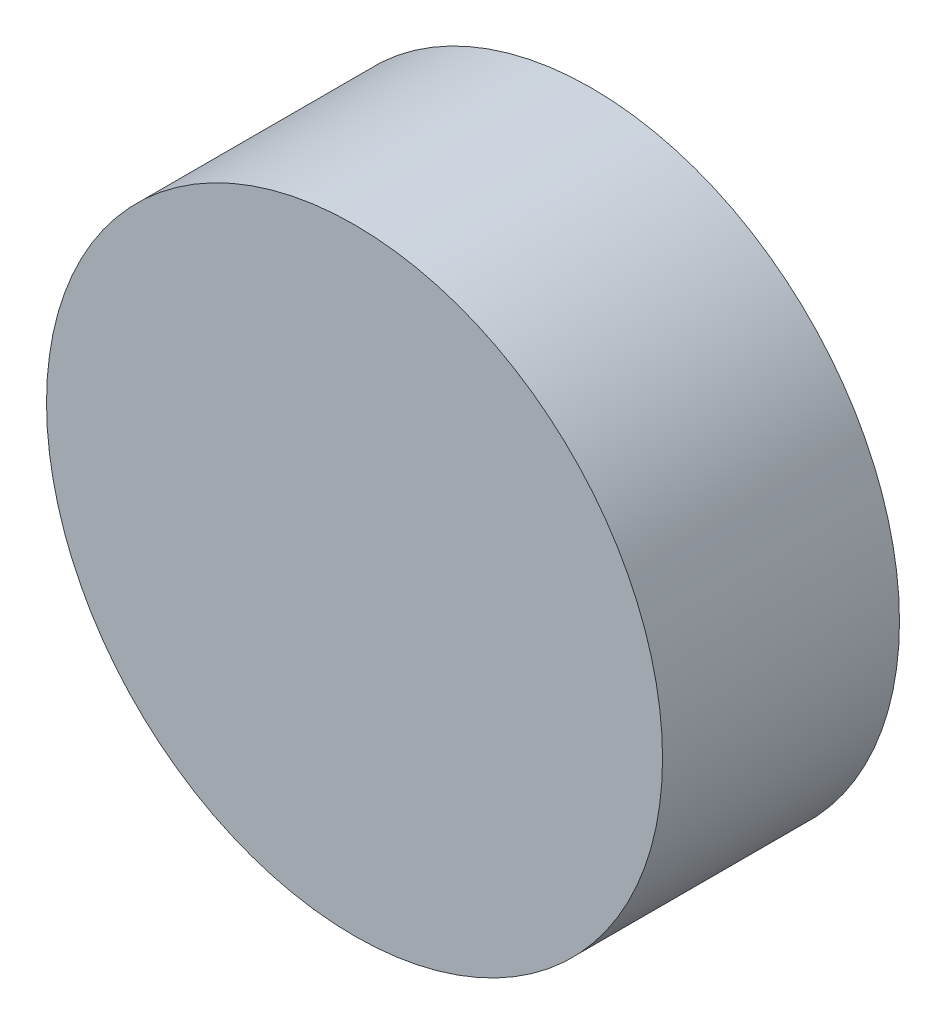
ISO-10303-21;
HEADER;
FILE_DESCRIPTION(('STEP AP214'),'2;1');
FILE_NAME('part.step','',(''),(''),'','','');
FILE_SCHEMA(('AUTOMOTIVE_DESIGN { 1 0 10303 214 1 1 1 1 }'));
ENDSEC;
DATA;
#1=APPLICATION_CONTEXT('core data for automotive mechanical design processes');
#2=APPLICATION_PROTOCOL_DEFINITION('international standard','automotive_design',2000,#1);
#3=PRODUCT_CONTEXT('',#1,'mechanical');
#4=PRODUCT('Part','Part','',(#3));
#5=PRODUCT_RELATED_PRODUCT_CATEGORY('part','',(#4));
#6=PRODUCT_DEFINITION_FORMATION('','',#4);
#7=PRODUCT_DEFINITION_CONTEXT('part definition',#1,'design');
#8=PRODUCT_DEFINITION('design','',#6,#7);
#9=PRODUCT_DEFINITION_SHAPE('','',#8);
#10=(LENGTH_UNIT() NAMED_UNIT(*) SI_UNIT(.MILLI.,.METRE.));
#11=(NAMED_UNIT(*) PLANE_ANGLE_UNIT() SI_UNIT($,.RADIAN.));
#12=(NAMED_UNIT(*) SI_UNIT($,.STERADIAN.) SOLID_ANGLE_UNIT());
#13=UNCERTAINTY_MEASURE_WITH_UNIT(LENGTH_MEASURE(1.E-05),#10,'distance_accuracy_value','');
#14=(GEOMETRIC_REPRESENTATION_CONTEXT(3) GLOBAL_UNCERTAINTY_ASSIGNED_CONTEXT((#13)) GLOBAL_UNIT_ASSIGNED_CONTEXT((#10,
#11,#12)) REPRESENTATION_CONTEXT('',''));
#15=CARTESIAN_POINT('',(0.,0.,0.));
#16=DIRECTION('',(0.,0.,1.));
#17=DIRECTION('',(1.,0.,0.));
#18=AXIS2_PLACEMENT_3D('',#15,#16,#17);
#19=CARTESIAN_POINT('',(0.,0.,5.));
#20=DIRECTION('',(0.,0.,-1.));
#21=DIRECTION('',(-0.999999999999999,0.,0.));
#22=AXIS2_PLACEMENT_3D('',#19,#20,#21);
#23=CYLINDRICAL_SURFACE('',#22,6.5);
#24=CARTESIAN_POINT('',(0.,0.,5.));
#25=DIRECTION('',(0.,0.,1.));
#26=DIRECTION('',(0.999999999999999,0.,0.));
#27=AXIS2_PLACEMENT_3D('',#24,#25,#26);
#28=CIRCLE('',#27,6.5);
#29=CARTESIAN_POINT('',(-6.49999999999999,0.,5.));
#30=VERTEX_POINT('',#29);
#31=EDGE_CURVE('E88',#30,#30,#28,.T.);
#32=CARTESIAN_POINT('',(0.,0.,0.));
#33=DIRECTION('',(0.,0.,1.));
#34=DIRECTION('',(0.999999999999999,0.,0.));
#35=AXIS2_PLACEMENT_3D('',#32,#33,#34);
#36=CIRCLE('',#35,6.5);
#37=CARTESIAN_POINT('',(-6.49999999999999,0.,0.));
#38=VERTEX_POINT('',#37);
#39=EDGE_CURVE('E85',#38,#38,#36,.T.);
#40=CARTESIAN_POINT('',(-6.49999999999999,0.,5.));
#41=CARTESIAN_POINT('',(-6.49999999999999,0.,4.94791666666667));
#42=CARTESIAN_POINT('',(-6.49999999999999,0.,4.89583333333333));
#43=CARTESIAN_POINT('',(-6.49999999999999,0.,4.79166666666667));
#44=CARTESIAN_POINT('',(-6.49999999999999,0.,4.73958333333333));
#45=CARTESIAN_POINT('',(-6.49999999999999,0.,4.63541666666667));
#46=CARTESIAN_POINT('',(-6.49999999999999,0.,4.58333333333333));
#47=CARTESIAN_POINT('',(-6.49999999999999,0.,4.47916666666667));
#48=CARTESIAN_POINT('',(-6.49999999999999,0.,4.42708333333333));
#49=CARTESIAN_POINT('',(-6.49999999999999,0.,4.32291666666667));
#50=CARTESIAN_POINT('',(-6.49999999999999,0.,4.27083333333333));
#51=CARTESIAN_POINT('',(-6.49999999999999,0.,4.16666666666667));
#52=CARTESIAN_POINT('',(-6.49999999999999,0.,4.11458333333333));
#53=CARTESIAN_POINT('',(-6.49999999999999,0.,4.01041666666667));
#54=CARTESIAN_POINT('',(-6.49999999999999,0.,3.95833333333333));
#55=CARTESIAN_POINT('',(-6.49999999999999,0.,3.85416666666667));
#56=CARTESIAN_POINT('',(-6.49999999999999,0.,3.80208333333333));
#57=CARTESIAN_POINT('',(-6.49999999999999,0.,3.69791666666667));
#58=CARTESIAN_POINT('',(-6.49999999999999,0.,3.64583333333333));
#59=CARTESIAN_POINT('',(-6.49999999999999,0.,3.54166666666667));
#60=CARTESIAN_POINT('',(-6.49999999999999,0.,3.48958333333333));
#61=CARTESIAN_POINT('',(-6.49999999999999,0.,3.38541666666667));
#62=CARTESIAN_POINT('',(-6.49999999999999,0.,3.33333333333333));
#63=CARTESIAN_POINT('',(-6.49999999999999,0.,3.22916666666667));
#64=CARTESIAN_POINT('',(-6.49999999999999,0.,3.17708333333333));
#65=CARTESIAN_POINT('',(-6.49999999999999,0.,3.07291666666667));
#66=CARTESIAN_POINT('',(-6.49999999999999,0.,3.02083333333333));
#67=CARTESIAN_POINT('',(-6.49999999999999,0.,2.91666666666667));
#68=CARTESIAN_POINT('',(-6.49999999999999,0.,2.86458333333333));
#69=CARTESIAN_POINT('',(-6.49999999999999,0.,2.76041666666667));
#70=CARTESIAN_POINT('',(-6.49999999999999,0.,2.70833333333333));
#71=CARTESIAN_POINT('',(-6.49999999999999,0.,2.60416666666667));
#72=CARTESIAN_POINT('',(-6.49999999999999,0.,2.55208333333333));
#73=CARTESIAN_POINT('',(-6.49999999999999,0.,2.44791666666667));
#74=CARTESIAN_POINT('',(-6.49999999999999,0.,2.39583333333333));
#75=CARTESIAN_POINT('',(-6.49999999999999,0.,2.29166666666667));
#76=CARTESIAN_POINT('',(-6.49999999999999,0.,2.23958333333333));
#77=CARTESIAN_POINT('',(-6.49999999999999,0.,2.13541666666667));
#78=CARTESIAN_POINT('',(-6.49999999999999,0.,2.08333333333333));
#79=CARTESIAN_POINT('',(-6.49999999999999,0.,1.97916666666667));
#80=CARTESIAN_POINT('',(-6.49999999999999,0.,1.92708333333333));
#81=CARTESIAN_POINT('',(-6.49999999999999,0.,1.82291666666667));
#82=CARTESIAN_POINT('',(-6.49999999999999,0.,1.77083333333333));
#83=CARTESIAN_POINT('',(-6.49999999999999,0.,1.66666666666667));
#84=CARTESIAN_POINT('',(-6.49999999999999,0.,1.61458333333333));
#85=CARTESIAN_POINT('',(-6.49999999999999,0.,1.51041666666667));
#86=CARTESIAN_POINT('',(-6.49999999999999,0.,1.45833333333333));
#87=CARTESIAN_POINT('',(-6.49999999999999,0.,1.35416666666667));
#88=CARTESIAN_POINT('',(-6.49999999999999,0.,1.30208333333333));
#89=CARTESIAN_POINT('',(-6.49999999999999,0.,1.19791666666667));
#90=CARTESIAN_POINT('',(-6.49999999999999,0.,1.14583333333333));
#91=CARTESIAN_POINT('',(-6.49999999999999,0.,1.04166666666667));
#92=CARTESIAN_POINT('',(-6.49999999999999,0.,0.989583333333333));
#93=CARTESIAN_POINT('',(-6.49999999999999,0.,0.885416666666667));
#94=CARTESIAN_POINT('',(-6.49999999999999,0.,0.833333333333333));
#95=CARTESIAN_POINT('',(-6.49999999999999,0.,0.729166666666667));
#96=CARTESIAN_POINT('',(-6.49999999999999,0.,0.677083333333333));
#97=CARTESIAN_POINT('',(-6.49999999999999,0.,0.572916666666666));
#98=CARTESIAN_POINT('',(-6.49999999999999,0.,0.520833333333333));
#99=CARTESIAN_POINT('',(-6.49999999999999,0.,0.416666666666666));
#100=CARTESIAN_POINT('',(-6.49999999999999,0.,0.364583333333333));
#101=CARTESIAN_POINT('',(-6.49999999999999,0.,0.260416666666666));
#102=CARTESIAN_POINT('',(-6.49999999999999,0.,0.208333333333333));
#103=CARTESIAN_POINT('',(-6.49999999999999,0.,0.104166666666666));
#104=CARTESIAN_POINT('',(-6.49999999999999,0.,0.0520833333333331));
#105=CARTESIAN_POINT('',(-6.49999999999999,0.,0.));
#106=B_SPLINE_CURVE_WITH_KNOTS('',3,(#40,#41,#42,#43,#44,#45,#46,#47,#48,#49,#50,#51,#52,#53,
#54,#55,#56,#57,#58,#59,#60,#61,#62,#63,#64,#65,#66,#67,#68,#69,#70,#71,#72,#73,#74,#75,#76,#77,
#78,#79,#80,#81,#82,#83,#84,#85,#86,#87,#88,#89,#90,#91,#92,#93,#94,#95,#96,#97,#98,#99,#100,
#101,#102,#103,#104,#105),.UNSPECIFIED.,.F.,.F.,(4,2,2,2,2,2,2,2,2,2,2,2,2,2,2,2,2,2,2,2,2,2,2,
2,2,2,2,2,2,2,2,2,4),(0.,0.15625,0.3125,0.46875,0.625000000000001,0.781250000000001,
0.937500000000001,1.09375,1.25,1.40625,1.5625,1.71875,1.875,2.03125,2.1875,2.34375,2.5,2.65625,
2.8125,2.96875,3.125,3.28125,3.4375,3.59375,3.75,3.90625,4.0625,4.21875,4.375,4.53125,4.6875,
4.84375,5.),.UNSPECIFIED.);
#107=EDGE_CURVE('BSEAM36',#30,#38,#106,.T.);
#108=ORIENTED_EDGE('',*,*,#31,.F.);
#109=ORIENTED_EDGE('',*,*,#39,.T.);
#110=ORIENTED_EDGE('',*,*,#107,.T.);
#111=ORIENTED_EDGE('',*,*,#107,.F.);
#112=EDGE_LOOP('',(#108,#110,#109,#111));
#113=FACE_BOUND('',#112,.T.);
#114=ADVANCED_FACE('F36',(#113),#23,.T.);
#115=CARTESIAN_POINT('',(0.,0.,5.));
#116=DIRECTION('',(0.,0.,1.));
#117=DIRECTION('',(0.999999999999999,0.,0.));
#118=AXIS2_PLACEMENT_3D('',#115,#116,#117);
#119=PLANE('',#118);
#120=ORIENTED_EDGE('',*,*,#31,.T.);
#121=EDGE_LOOP('',(#120));
#122=FACE_BOUND('',#121,.T.);
#123=ADVANCED_FACE('F108',(#122),#119,.T.);
#124=CARTESIAN_POINT('',(0.,0.,0.));
#125=DIRECTION('',(0.,0.,1.));
#126=DIRECTION('',(0.999999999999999,0.,0.));
#127=AXIS2_PLACEMENT_3D('',#124,#125,#126);
#128=PLANE('',#127);
#129=CARTESIAN_POINT('',(0.,0.,0.));
#130=DIRECTION('',(0.,0.,1.));
#131=DIRECTION('',(0.999999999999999,0.,0.));
#132=AXIS2_PLACEMENT_3D('',#129,#130,#131);
#133=CIRCLE('',#132,2.7);
#134=CARTESIAN_POINT('',(-2.69999999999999,0.,0.));
#135=VERTEX_POINT('',#134);
#136=EDGE_CURVE('E11',#135,#135,#133,.T.);
#137=ORIENTED_EDGE('',*,*,#136,.T.);
#138=EDGE_LOOP('',(#137));
#139=FACE_BOUND('',#138,.T.);
#140=CARTESIAN_POINT('',(2.12714448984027,-3.68432233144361,0.));
#141=DIRECTION('',(0.,0.,-1.));
#142=DIRECTION('',(0.499999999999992,-0.866025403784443,0.));
#143=AXIS2_PLACEMENT_3D('',#140,#141,#142);
#144=CIRCLE('',#143,1.);
#145=CARTESIAN_POINT('',(1.12714448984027,-3.68432233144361,0.));
#146=VERTEX_POINT('',#145);
#147=EDGE_CURVE('E287',#146,#146,#144,.T.);
#148=ORIENTED_EDGE('',*,*,#147,.F.);
#149=EDGE_LOOP('',(#148));
#150=FACE_BOUND('',#149,.T.);
#151=CARTESIAN_POINT('',(2.12714448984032,3.68432233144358,0.));
#152=DIRECTION('',(0.,0.,-1.));
#153=DIRECTION('',(0.500000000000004,0.866025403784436,0.));
#154=AXIS2_PLACEMENT_3D('',#151,#152,#153);
#155=CIRCLE('',#154,1.);
#156=CARTESIAN_POINT('',(1.12714448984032,3.68432233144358,0.));
#157=VERTEX_POINT('',#156);
#158=EDGE_CURVE('E286',#157,#157,#155,.T.);
#159=ORIENTED_EDGE('',*,*,#158,.F.);
#160=EDGE_LOOP('',(#159));
#161=FACE_BOUND('',#160,.T.);
#162=CARTESIAN_POINT('',(-4.2542889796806,0.,0.));
#163=DIRECTION('',(0.,0.,-1.));
#164=DIRECTION('',(-0.999999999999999,0.,0.));
#165=AXIS2_PLACEMENT_3D('',#162,#163,#164);
#166=CIRCLE('',#165,1.);
#167=CARTESIAN_POINT('',(-5.2542889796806,0.,0.));
#168=VERTEX_POINT('',#167);
#169=EDGE_CURVE('E70',#168,#168,#166,.T.);
#170=ORIENTED_EDGE('',*,*,#169,.F.);
#171=EDGE_LOOP('',(#170));
#172=FACE_BOUND('',#171,.T.);
#173=CARTESIAN_POINT('',(-4.24352447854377,-2.44999999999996,0.));
#174=DIRECTION('',(0.,0.,-1.));
#175=DIRECTION('',(-0.999999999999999,0.,0.));
#176=AXIS2_PLACEMENT_3D('',#173,#174,#175);
#177=CIRCLE('',#176,0.799999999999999);
#178=CARTESIAN_POINT('',(-5.04352447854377,-2.44999999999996,0.));
#179=VERTEX_POINT('',#178);
#180=EDGE_CURVE('E63',#179,#179,#177,.T.);
#181=ORIENTED_EDGE('',*,*,#180,.F.);
#182=EDGE_LOOP('',(#181));
#183=FACE_BOUND('',#182,.T.);
#184=CARTESIAN_POINT('',(4.24352447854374,-2.45000000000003,0.));
#185=DIRECTION('',(0.,0.,-1.));
#186=DIRECTION('',(-0.999999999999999,0.,0.));
#187=AXIS2_PLACEMENT_3D('',#184,#185,#186);
#188=CIRCLE('',#187,0.799999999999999);
#189=CARTESIAN_POINT('',(3.44352447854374,-2.45000000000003,0.));
#190=VERTEX_POINT('',#189);
#191=EDGE_CURVE('E76',#190,#190,#188,.T.);
#192=ORIENTED_EDGE('',*,*,#191,.F.);
#193=EDGE_LOOP('',(#192));
#194=FACE_BOUND('',#193,.T.);
#195=CARTESIAN_POINT('',(0.,4.89999999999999,0.));
#196=DIRECTION('',(0.,0.,-1.));
#197=DIRECTION('',(-0.999999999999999,0.,0.));
#198=AXIS2_PLACEMENT_3D('',#195,#196,#197);
#199=CIRCLE('',#198,0.799999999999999);
#200=CARTESIAN_POINT('',(-0.799999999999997,4.89999999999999,0.));
#201=VERTEX_POINT('',#200);
#202=EDGE_CURVE('E82',#201,#201,#199,.T.);
#203=ORIENTED_EDGE('',*,*,#202,.F.);
#204=EDGE_LOOP('',(#203));
#205=FACE_BOUND('',#204,.T.);
#206=ORIENTED_EDGE('',*,*,#39,.F.);
#207=EDGE_LOOP('',(#206));
#208=FACE_BOUND('',#207,.T.);
#209=ADVANCED_FACE('F113',(#139,#150,#161,#172,#183,#194,#205,#208),#128,.F.);
#210=CARTESIAN_POINT('',(0.,4.89999999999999,0.));
#211=DIRECTION('',(0.,0.,-1.));
#212=DIRECTION('',(-0.999999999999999,0.,0.));
#213=AXIS2_PLACEMENT_3D('',#210,#211,#212);
#214=CYLINDRICAL_SURFACE('',#213,0.799999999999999);
#215=CARTESIAN_POINT('',(0.,4.89999999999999,4.2));
#216=DIRECTION('',(0.,0.,-1.));
#217=DIRECTION('',(-0.999999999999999,0.,0.));
#218=AXIS2_PLACEMENT_3D('',#215,#216,#217);
#219=CIRCLE('',#218,0.799999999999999);
#220=CARTESIAN_POINT('',(-0.799999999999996,4.89999999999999,4.2));
#221=VERTEX_POINT('',#220);
#222=EDGE_CURVE('E79',#221,#221,#219,.T.);
#223=CARTESIAN_POINT('',(-0.799999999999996,4.89999999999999,4.2));
#224=CARTESIAN_POINT('',(-0.799999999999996,4.89999999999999,4.15624999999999));
#225=CARTESIAN_POINT('',(-0.799999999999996,4.89999999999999,4.1125));
#226=CARTESIAN_POINT('',(-0.799999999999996,4.89999999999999,4.025));
#227=CARTESIAN_POINT('',(-0.799999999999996,4.89999999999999,3.98125));
#228=CARTESIAN_POINT('',(-0.799999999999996,4.89999999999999,3.89374999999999));
#229=CARTESIAN_POINT('',(-0.799999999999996,4.89999999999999,3.84999999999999));
#230=CARTESIAN_POINT('',(-0.799999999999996,4.89999999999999,3.76249999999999));
#231=CARTESIAN_POINT('',(-0.799999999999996,4.89999999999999,3.71875));
#232=CARTESIAN_POINT('',(-0.799999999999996,4.89999999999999,3.63125));
#233=CARTESIAN_POINT('',(-0.799999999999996,4.89999999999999,3.58749999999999));
#234=CARTESIAN_POINT('',(-0.799999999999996,4.89999999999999,3.49999999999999));
#235=CARTESIAN_POINT('',(-0.799999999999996,4.89999999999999,3.45624999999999));
#236=CARTESIAN_POINT('',(-0.799999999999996,4.89999999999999,3.36875));
#237=CARTESIAN_POINT('',(-0.799999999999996,4.89999999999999,3.32499999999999));
#238=CARTESIAN_POINT('',(-0.799999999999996,4.89999999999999,3.23749999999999));
#239=CARTESIAN_POINT('',(-0.799999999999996,4.89999999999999,3.19374999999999));
#240=CARTESIAN_POINT('',(-0.799999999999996,4.89999999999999,3.10624999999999));
#241=CARTESIAN_POINT('',(-0.799999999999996,4.89999999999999,3.0625));
#242=CARTESIAN_POINT('',(-0.799999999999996,4.89999999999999,2.975));
#243=CARTESIAN_POINT('',(-0.799999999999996,4.89999999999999,2.93124999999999));
#244=CARTESIAN_POINT('',(-0.799999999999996,4.89999999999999,2.84374999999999));
#245=CARTESIAN_POINT('',(-0.799999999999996,4.89999999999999,2.79999999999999));
#246=CARTESIAN_POINT('',(-0.799999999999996,4.89999999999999,2.71249999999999));
#247=CARTESIAN_POINT('',(-0.799999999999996,4.89999999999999,2.66874999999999));
#248=CARTESIAN_POINT('',(-0.799999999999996,4.89999999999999,2.58124999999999));
#249=CARTESIAN_POINT('',(-0.799999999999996,4.89999999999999,2.53749999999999));
#250=CARTESIAN_POINT('',(-0.799999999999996,4.89999999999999,2.44999999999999));
#251=CARTESIAN_POINT('',(-0.799999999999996,4.89999999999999,2.40624999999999));
#252=CARTESIAN_POINT('',(-0.799999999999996,4.89999999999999,2.31874999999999));
#253=CARTESIAN_POINT('',(-0.799999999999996,4.89999999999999,2.27499999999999));
#254=CARTESIAN_POINT('',(-0.799999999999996,4.89999999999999,2.18749999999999));
#255=CARTESIAN_POINT('',(-0.799999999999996,4.89999999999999,2.14374999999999));
#256=CARTESIAN_POINT('',(-0.799999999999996,4.89999999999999,2.05624999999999));
#257=CARTESIAN_POINT('',(-0.799999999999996,4.89999999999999,2.01249999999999));
#258=CARTESIAN_POINT('',(-0.799999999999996,4.89999999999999,1.92499999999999));
#259=CARTESIAN_POINT('',(-0.799999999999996,4.89999999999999,1.88124999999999));
#260=CARTESIAN_POINT('',(-0.799999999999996,4.89999999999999,1.79374999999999));
#261=CARTESIAN_POINT('',(-0.799999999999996,4.89999999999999,1.74999999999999));
#262=CARTESIAN_POINT('',(-0.799999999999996,4.89999999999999,1.66249999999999));
#263=CARTESIAN_POINT('',(-0.799999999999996,4.89999999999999,1.61874999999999));
#264=CARTESIAN_POINT('',(-0.799999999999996,4.89999999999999,1.53124999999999));
#265=CARTESIAN_POINT('',(-0.799999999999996,4.89999999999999,1.48749999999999));
#266=CARTESIAN_POINT('',(-0.799999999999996,4.89999999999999,1.39999999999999));
#267=CARTESIAN_POINT('',(-0.799999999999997,4.89999999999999,1.35624999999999));
#268=CARTESIAN_POINT('',(-0.799999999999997,4.89999999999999,1.26874999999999));
#269=CARTESIAN_POINT('',(-0.799999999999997,4.89999999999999,1.22499999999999));
#270=CARTESIAN_POINT('',(-0.799999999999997,4.89999999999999,1.13749999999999));
#271=CARTESIAN_POINT('',(-0.799999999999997,4.89999999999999,1.09374999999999));
#272=CARTESIAN_POINT('',(-0.799999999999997,4.89999999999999,1.00624999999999));
#273=CARTESIAN_POINT('',(-0.799999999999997,4.89999999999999,0.962499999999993));
#274=CARTESIAN_POINT('',(-0.799999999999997,4.89999999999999,0.874999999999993));
#275=CARTESIAN_POINT('',(-0.799999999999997,4.89999999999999,0.831249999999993));
#276=CARTESIAN_POINT('',(-0.799999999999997,4.89999999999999,0.743749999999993));
#277=CARTESIAN_POINT('',(-0.799999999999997,4.89999999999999,0.699999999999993));
#278=CARTESIAN_POINT('',(-0.799999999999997,4.89999999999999,0.612499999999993));
#279=CARTESIAN_POINT('',(-0.799999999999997,4.89999999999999,0.568749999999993));
#280=CARTESIAN_POINT('',(-0.799999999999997,4.89999999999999,0.481249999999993));
#281=CARTESIAN_POINT('',(-0.799999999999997,4.89999999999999,0.437499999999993));
#282=CARTESIAN_POINT('',(-0.799999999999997,4.89999999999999,0.349999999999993));
#283=CARTESIAN_POINT('',(-0.799999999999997,4.89999999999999,0.306249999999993));
#284=CARTESIAN_POINT('',(-0.799999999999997,4.89999999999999,0.218749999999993));
#285=CARTESIAN_POINT('',(-0.799999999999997,4.89999999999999,0.174999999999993));
#286=CARTESIAN_POINT('',(-0.799999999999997,4.89999999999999,0.0874999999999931));
#287=CARTESIAN_POINT('',(-0.799999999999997,4.89999999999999,0.043749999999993));
#288=CARTESIAN_POINT('',(-0.799999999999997,4.89999999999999,0.));
#289=B_SPLINE_CURVE_WITH_KNOTS('',3,(#223,#224,#225,#226,#227,#228,#229,#230,#231,#232,#233,
#234,#235,#236,#237,#238,#239,#240,#241,#242,#243,#244,#245,#246,#247,#248,#249,#250,#251,#252,
#253,#254,#255,#256,#257,#258,#259,#260,#261,#262,#263,#264,#265,#266,#267,#268,#269,#270,#271,
#272,#273,#274,#275,#276,#277,#278,#279,#280,#281,#282,#283,#284,#285,#286,#287,#288),
.UNSPECIFIED.,.F.,.F.,(4,2,2,2,2,2,2,2,2,2,2,2,2,2,2,2,2,2,2,2,2,2,2,2,2,2,2,2,2,2,2,2,4),(0.,
0.13125,0.262500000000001,0.39375,0.525,0.656250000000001,0.7875,0.918750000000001,1.05,1.18125,
1.3125,1.44375,1.575,1.70625,1.8375,1.96875,2.1,2.23125,2.3625,2.49375,2.625,2.75625,2.8875,
3.01875,3.15,3.28125,3.4125,3.54375,3.675,3.80625,3.9375,4.06875,4.2),.UNSPECIFIED.);
#290=EDGE_CURVE('BSEAM120',#221,#201,#289,.T.);
#291=ORIENTED_EDGE('',*,*,#222,.F.);
#292=ORIENTED_EDGE('',*,*,#202,.T.);
#293=ORIENTED_EDGE('',*,*,#290,.T.);
#294=ORIENTED_EDGE('',*,*,#290,.F.);
#295=EDGE_LOOP('',(#291,#293,#292,#294));
#296=FACE_BOUND('',#295,.T.);
#297=ADVANCED_FACE('F120',(#296),#214,.F.);
#298=CARTESIAN_POINT('',(0.,4.89999999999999,4.2));
#299=DIRECTION('',(0.,0.,-1.));
#300=DIRECTION('',(-0.999999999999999,0.,0.));
#301=AXIS2_PLACEMENT_3D('',#298,#299,#300);
#302=CONICAL_SURFACE('',#301,0.799999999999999,1.02974425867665);
#303=CARTESIAN_POINT('',(0.,4.89999999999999,4.68068849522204));
#304=VERTEX_POINT('',#303);
#305=VERTEX_LOOP('',#304);
#306=FACE_BOUND('',#305,.T.);
#307=ORIENTED_EDGE('',*,*,#222,.T.);
#308=EDGE_LOOP('',(#307));
#309=FACE_BOUND('',#308,.T.);
#310=ADVANCED_FACE('F126',(#306,#309),#302,.F.);
#311=CARTESIAN_POINT('',(4.24352447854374,-2.45000000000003,0.));
#312=DIRECTION('',(0.,0.,-1.));
#313=DIRECTION('',(-0.999999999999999,0.,0.));
#314=AXIS2_PLACEMENT_3D('',#311,#312,#313);
#315=CYLINDRICAL_SURFACE('',#314,0.799999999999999);
#316=CARTESIAN_POINT('',(4.24352447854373,-2.45000000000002,4.19999999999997));
#317=DIRECTION('',(0.,0.,-1.));
#318=DIRECTION('',(-0.999999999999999,0.,0.));
#319=AXIS2_PLACEMENT_3D('',#316,#317,#318);
#320=CIRCLE('',#319,0.799999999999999);
#321=CARTESIAN_POINT('',(3.44352447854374,-2.45000000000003,4.19999999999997));
#322=VERTEX_POINT('',#321);
#323=EDGE_CURVE('E67',#322,#322,#320,.T.);
#324=CARTESIAN_POINT('',(3.44352447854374,-2.45000000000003,4.19999999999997));
#325=CARTESIAN_POINT('',(3.44352447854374,-2.45000000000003,4.15624999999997));
#326=CARTESIAN_POINT('',(3.44352447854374,-2.45000000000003,4.11249999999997));
#327=CARTESIAN_POINT('',(3.44352447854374,-2.45000000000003,4.02499999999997));
#328=CARTESIAN_POINT('',(3.44352447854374,-2.45000000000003,3.98124999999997));
#329=CARTESIAN_POINT('',(3.44352447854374,-2.45000000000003,3.89374999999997));
#330=CARTESIAN_POINT('',(3.44352447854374,-2.45000000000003,3.84999999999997));
#331=CARTESIAN_POINT('',(3.44352447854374,-2.45000000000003,3.76249999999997));
#332=CARTESIAN_POINT('',(3.44352447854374,-2.45000000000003,3.71874999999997));
#333=CARTESIAN_POINT('',(3.44352447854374,-2.45000000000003,3.63124999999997));
#334=CARTESIAN_POINT('',(3.44352447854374,-2.45000000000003,3.58749999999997));
#335=CARTESIAN_POINT('',(3.44352447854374,-2.45000000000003,3.49999999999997));
#336=CARTESIAN_POINT('',(3.44352447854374,-2.45000000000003,3.45624999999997));
#337=CARTESIAN_POINT('',(3.44352447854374,-2.45000000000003,3.36874999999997));
#338=CARTESIAN_POINT('',(3.44352447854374,-2.45000000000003,3.32499999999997));
#339=CARTESIAN_POINT('',(3.44352447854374,-2.45000000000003,3.23749999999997));
#340=CARTESIAN_POINT('',(3.44352447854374,-2.45000000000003,3.19374999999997));
#341=CARTESIAN_POINT('',(3.44352447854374,-2.45000000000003,3.10624999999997));
#342=CARTESIAN_POINT('',(3.44352447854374,-2.45000000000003,3.06249999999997));
#343=CARTESIAN_POINT('',(3.44352447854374,-2.45000000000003,2.97499999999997));
#344=CARTESIAN_POINT('',(3.44352447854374,-2.45000000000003,2.93124999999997));
#345=CARTESIAN_POINT('',(3.44352447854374,-2.45000000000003,2.84374999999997));
#346=CARTESIAN_POINT('',(3.44352447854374,-2.45000000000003,2.79999999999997));
#347=CARTESIAN_POINT('',(3.44352447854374,-2.45000000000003,2.71249999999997));
#348=CARTESIAN_POINT('',(3.44352447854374,-2.45000000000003,2.66874999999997));
#349=CARTESIAN_POINT('',(3.44352447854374,-2.45000000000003,2.58124999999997));
#350=CARTESIAN_POINT('',(3.44352447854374,-2.45000000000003,2.53749999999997));
#351=CARTESIAN_POINT('',(3.44352447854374,-2.45000000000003,2.44999999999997));
#352=CARTESIAN_POINT('',(3.44352447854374,-2.45000000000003,2.40624999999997));
#353=CARTESIAN_POINT('',(3.44352447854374,-2.45000000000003,2.31874999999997));
#354=CARTESIAN_POINT('',(3.44352447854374,-2.45000000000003,2.27499999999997));
#355=CARTESIAN_POINT('',(3.44352447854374,-2.45000000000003,2.18749999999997));
#356=CARTESIAN_POINT('',(3.44352447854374,-2.45000000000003,2.14374999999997));
#357=CARTESIAN_POINT('',(3.44352447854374,-2.45000000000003,2.05624999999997));
#358=CARTESIAN_POINT('',(3.44352447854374,-2.45000000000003,2.01249999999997));
#359=CARTESIAN_POINT('',(3.44352447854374,-2.45000000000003,1.92499999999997));
#360=CARTESIAN_POINT('',(3.44352447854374,-2.45000000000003,1.88124999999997));
#361=CARTESIAN_POINT('',(3.44352447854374,-2.45000000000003,1.79374999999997));
#362=CARTESIAN_POINT('',(3.44352447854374,-2.45000000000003,1.74999999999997));
#363=CARTESIAN_POINT('',(3.44352447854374,-2.45000000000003,1.66249999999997));
#364=CARTESIAN_POINT('',(3.44352447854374,-2.45000000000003,1.61874999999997));
#365=CARTESIAN_POINT('',(3.44352447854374,-2.45000000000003,1.53124999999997));
#366=CARTESIAN_POINT('',(3.44352447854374,-2.45000000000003,1.48749999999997));
#367=CARTESIAN_POINT('',(3.44352447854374,-2.45000000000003,1.39999999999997));
#368=CARTESIAN_POINT('',(3.44352447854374,-2.45000000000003,1.35624999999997));
#369=CARTESIAN_POINT('',(3.44352447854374,-2.45000000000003,1.26874999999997));
#370=CARTESIAN_POINT('',(3.44352447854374,-2.45000000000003,1.22499999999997));
#371=CARTESIAN_POINT('',(3.44352447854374,-2.45000000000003,1.13749999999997));
#372=CARTESIAN_POINT('',(3.44352447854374,-2.45000000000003,1.09374999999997));
#373=CARTESIAN_POINT('',(3.44352447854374,-2.45000000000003,1.00624999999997));
#374=CARTESIAN_POINT('',(3.44352447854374,-2.45000000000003,0.962499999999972));
#375=CARTESIAN_POINT('',(3.44352447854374,-2.45000000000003,0.874999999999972));
#376=CARTESIAN_POINT('',(3.44352447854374,-2.45000000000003,0.831249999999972));
#377=CARTESIAN_POINT('',(3.44352447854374,-2.45000000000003,0.743749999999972));
#378=CARTESIAN_POINT('',(3.44352447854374,-2.45000000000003,0.699999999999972));
#379=CARTESIAN_POINT('',(3.44352447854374,-2.45000000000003,0.612499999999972));
#380=CARTESIAN_POINT('',(3.44352447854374,-2.45000000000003,0.568749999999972));
#381=CARTESIAN_POINT('',(3.44352447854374,-2.45000000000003,0.481249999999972));
#382=CARTESIAN_POINT('',(3.44352447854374,-2.45000000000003,0.437499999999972));
#383=CARTESIAN_POINT('',(3.44352447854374,-2.45000000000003,0.349999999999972));
#384=CARTESIAN_POINT('',(3.44352447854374,-2.45000000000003,0.306249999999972));
#385=CARTESIAN_POINT('',(3.44352447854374,-2.45000000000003,0.218749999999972));
#386=CARTESIAN_POINT('',(3.44352447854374,-2.45000000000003,0.174999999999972));
#387=CARTESIAN_POINT('',(3.44352447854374,-2.45000000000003,0.0874999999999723));
#388=CARTESIAN_POINT('',(3.44352447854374,-2.45000000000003,0.0437499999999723));
#389=CARTESIAN_POINT('',(3.44352447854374,-2.45000000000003,0.));
#390=B_SPLINE_CURVE_WITH_KNOTS('',3,(#324,#325,#326,#327,#328,#329,#330,#331,#332,#333,#334,
#335,#336,#337,#338,#339,#340,#341,#342,#343,#344,#345,#346,#347,#348,#349,#350,#351,#352,#353,
#354,#355,#356,#357,#358,#359,#360,#361,#362,#363,#364,#365,#366,#367,#368,#369,#370,#371,#372,
#373,#374,#375,#376,#377,#378,#379,#380,#381,#382,#383,#384,#385,#386,#387,#388,#389),
.UNSPECIFIED.,.F.,.F.,(4,2,2,2,2,2,2,2,2,2,2,2,2,2,2,2,2,2,2,2,2,2,2,2,2,2,2,2,2,2,2,2,4),(0.,
0.13125,0.2625,0.39375,0.525,0.65625,0.7875,0.91875,1.05,1.18125,1.3125,1.44375,1.575,1.70625,
1.8375,1.96875,2.1,2.23125,2.3625,2.49375,2.625,2.75625,2.8875,3.01875,3.15,3.28125,3.4125,
3.54375,3.675,3.80625,3.9375,4.06875,4.2),.UNSPECIFIED.);
#391=EDGE_CURVE('BSEAM133',#322,#190,#390,.T.);
#392=ORIENTED_EDGE('',*,*,#323,.F.);
#393=ORIENTED_EDGE('',*,*,#191,.T.);
#394=ORIENTED_EDGE('',*,*,#391,.T.);
#395=ORIENTED_EDGE('',*,*,#391,.F.);
#396=EDGE_LOOP('',(#392,#394,#393,#395));
#397=FACE_BOUND('',#396,.T.);
#398=ADVANCED_FACE('F133',(#397),#315,.F.);
#399=CARTESIAN_POINT('',(4.24352447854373,-2.45000000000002,4.19999999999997));
#400=DIRECTION('',(0.,0.,-1.));
#401=DIRECTION('',(-0.999999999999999,0.,0.));
#402=AXIS2_PLACEMENT_3D('',#399,#400,#401);
#403=CONICAL_SURFACE('',#402,0.799999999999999,1.02974425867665);
#404=CARTESIAN_POINT('',(4.24352447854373,-2.45000000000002,4.68068849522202));
#405=VERTEX_POINT('',#404);
#406=VERTEX_LOOP('',#405);
#407=FACE_BOUND('',#406,.T.);
#408=ORIENTED_EDGE('',*,*,#323,.T.);
#409=EDGE_LOOP('',(#408));
#410=FACE_BOUND('',#409,.T.);
#411=ADVANCED_FACE('F136',(#407,#410),#403,.F.);
#412=CARTESIAN_POINT('',(-4.24352447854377,-2.44999999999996,0.));
#413=DIRECTION('',(0.,0.,-1.));
#414=DIRECTION('',(-0.999999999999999,0.,0.));
#415=AXIS2_PLACEMENT_3D('',#412,#413,#414);
#416=CYLINDRICAL_SURFACE('',#415,0.799999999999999);
#417=CARTESIAN_POINT('',(-4.24352447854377,-2.44999999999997,4.2));
#418=DIRECTION('',(0.,0.,-1.));
#419=DIRECTION('',(-0.999999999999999,0.,0.));
#420=AXIS2_PLACEMENT_3D('',#417,#418,#419);
#421=CIRCLE('',#420,0.799999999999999);
#422=CARTESIAN_POINT('',(-5.04352447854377,-2.44999999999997,4.2));
#423=VERTEX_POINT('',#422);
#424=EDGE_CURVE('E61',#423,#423,#421,.T.);
#425=CARTESIAN_POINT('',(-5.04352447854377,-2.44999999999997,4.2));
#426=CARTESIAN_POINT('',(-5.04352447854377,-2.44999999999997,4.15625));
#427=CARTESIAN_POINT('',(-5.04352447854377,-2.44999999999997,4.1125));
#428=CARTESIAN_POINT('',(-5.04352447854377,-2.44999999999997,4.025));
#429=CARTESIAN_POINT('',(-5.04352447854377,-2.44999999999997,3.98125));
#430=CARTESIAN_POINT('',(-5.04352447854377,-2.44999999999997,3.89375));
#431=CARTESIAN_POINT('',(-5.04352447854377,-2.44999999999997,3.85));
#432=CARTESIAN_POINT('',(-5.04352447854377,-2.44999999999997,3.7625));
#433=CARTESIAN_POINT('',(-5.04352447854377,-2.44999999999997,3.71875));
#434=CARTESIAN_POINT('',(-5.04352447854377,-2.44999999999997,3.63125));
#435=CARTESIAN_POINT('',(-5.04352447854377,-2.44999999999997,3.5875));
#436=CARTESIAN_POINT('',(-5.04352447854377,-2.44999999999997,3.5));
#437=CARTESIAN_POINT('',(-5.04352447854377,-2.44999999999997,3.45625));
#438=CARTESIAN_POINT('',(-5.04352447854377,-2.44999999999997,3.36875));
#439=CARTESIAN_POINT('',(-5.04352447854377,-2.44999999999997,3.325));
#440=CARTESIAN_POINT('',(-5.04352447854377,-2.44999999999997,3.2375));
#441=CARTESIAN_POINT('',(-5.04352447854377,-2.44999999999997,3.19375));
#442=CARTESIAN_POINT('',(-5.04352447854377,-2.44999999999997,3.10625));
#443=CARTESIAN_POINT('',(-5.04352447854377,-2.44999999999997,3.0625));
#444=CARTESIAN_POINT('',(-5.04352447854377,-2.44999999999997,2.975));
#445=CARTESIAN_POINT('',(-5.04352447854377,-2.44999999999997,2.93125));
#446=CARTESIAN_POINT('',(-5.04352447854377,-2.44999999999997,2.84375));
#447=CARTESIAN_POINT('',(-5.04352447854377,-2.44999999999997,2.8));
#448=CARTESIAN_POINT('',(-5.04352447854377,-2.44999999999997,2.7125));
#449=CARTESIAN_POINT('',(-5.04352447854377,-2.44999999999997,2.66875));
#450=CARTESIAN_POINT('',(-5.04352447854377,-2.44999999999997,2.58125));
#451=CARTESIAN_POINT('',(-5.04352447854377,-2.44999999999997,2.5375));
#452=CARTESIAN_POINT('',(-5.04352447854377,-2.44999999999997,2.45));
#453=CARTESIAN_POINT('',(-5.04352447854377,-2.44999999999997,2.40625));
#454=CARTESIAN_POINT('',(-5.04352447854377,-2.44999999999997,2.31875));
#455=CARTESIAN_POINT('',(-5.04352447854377,-2.44999999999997,2.275));
#456=CARTESIAN_POINT('',(-5.04352447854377,-2.44999999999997,2.1875));
#457=CARTESIAN_POINT('',(-5.04352447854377,-2.44999999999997,2.14375));
#458=CARTESIAN_POINT('',(-5.04352447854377,-2.44999999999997,2.05625));
#459=CARTESIAN_POINT('',(-5.04352447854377,-2.44999999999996,2.0125));
#460=CARTESIAN_POINT('',(-5.04352447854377,-2.44999999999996,1.925));
#461=CARTESIAN_POINT('',(-5.04352447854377,-2.44999999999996,1.88125));
#462=CARTESIAN_POINT('',(-5.04352447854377,-2.44999999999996,1.79375));
#463=CARTESIAN_POINT('',(-5.04352447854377,-2.44999999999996,1.75));
#464=CARTESIAN_POINT('',(-5.04352447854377,-2.44999999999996,1.6625));
#465=CARTESIAN_POINT('',(-5.04352447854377,-2.44999999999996,1.61875));
#466=CARTESIAN_POINT('',(-5.04352447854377,-2.44999999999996,1.53125));
#467=CARTESIAN_POINT('',(-5.04352447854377,-2.44999999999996,1.4875));
#468=CARTESIAN_POINT('',(-5.04352447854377,-2.44999999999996,1.4));
#469=CARTESIAN_POINT('',(-5.04352447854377,-2.44999999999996,1.35625));
#470=CARTESIAN_POINT('',(-5.04352447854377,-2.44999999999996,1.26875));
#471=CARTESIAN_POINT('',(-5.04352447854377,-2.44999999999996,1.225));
#472=CARTESIAN_POINT('',(-5.04352447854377,-2.44999999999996,1.1375));
#473=CARTESIAN_POINT('',(-5.04352447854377,-2.44999999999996,1.09375));
#474=CARTESIAN_POINT('',(-5.04352447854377,-2.44999999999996,1.00625));
#475=CARTESIAN_POINT('',(-5.04352447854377,-2.44999999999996,0.9625));
#476=CARTESIAN_POINT('',(-5.04352447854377,-2.44999999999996,0.875));
#477=CARTESIAN_POINT('',(-5.04352447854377,-2.44999999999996,0.83125));
#478=CARTESIAN_POINT('',(-5.04352447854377,-2.44999999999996,0.74375));
#479=CARTESIAN_POINT('',(-5.04352447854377,-2.44999999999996,0.7));
#480=CARTESIAN_POINT('',(-5.04352447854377,-2.44999999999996,0.6125));
#481=CARTESIAN_POINT('',(-5.04352447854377,-2.44999999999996,0.56875));
#482=CARTESIAN_POINT('',(-5.04352447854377,-2.44999999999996,0.48125));
#483=CARTESIAN_POINT('',(-5.04352447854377,-2.44999999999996,0.4375));
#484=CARTESIAN_POINT('',(-5.04352447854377,-2.44999999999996,0.35));
#485=CARTESIAN_POINT('',(-5.04352447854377,-2.44999999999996,0.30625));
#486=CARTESIAN_POINT('',(-5.04352447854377,-2.44999999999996,0.21875));
#487=CARTESIAN_POINT('',(-5.04352447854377,-2.44999999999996,0.175));
#488=CARTESIAN_POINT('',(-5.04352447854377,-2.44999999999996,0.0875000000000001));
#489=CARTESIAN_POINT('',(-5.04352447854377,-2.44999999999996,0.04375));
#490=CARTESIAN_POINT('',(-5.04352447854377,-2.44999999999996,0.));
#491=B_SPLINE_CURVE_WITH_KNOTS('',3,(#425,#426,#427,#428,#429,#430,#431,#432,#433,#434,#435,
#436,#437,#438,#439,#440,#441,#442,#443,#444,#445,#446,#447,#448,#449,#450,#451,#452,#453,#454,
#455,#456,#457,#458,#459,#460,#461,#462,#463,#464,#465,#466,#467,#468,#469,#470,#471,#472,#473,
#474,#475,#476,#477,#478,#479,#480,#481,#482,#483,#484,#485,#486,#487,#488,#489,#490),
.UNSPECIFIED.,.F.,.F.,(4,2,2,2,2,2,2,2,2,2,2,2,2,2,2,2,2,2,2,2,2,2,2,2,2,2,2,2,2,2,2,2,4),(0.,
0.13125,0.2625,0.39375,0.525,0.65625,0.7875,0.91875,1.05,1.18125,1.3125,1.44375,1.575,1.70625,
1.8375,1.96875,2.1,2.23125,2.3625,2.49375,2.625,2.75625,2.8875,3.01875,3.15,3.28125,3.4125,
3.54375,3.675,3.80625,3.9375,4.06875,4.2),.UNSPECIFIED.);
#492=EDGE_CURVE('BSEAM57',#423,#179,#491,.T.);
#493=ORIENTED_EDGE('',*,*,#424,.F.);
#494=ORIENTED_EDGE('',*,*,#180,.T.);
#495=ORIENTED_EDGE('',*,*,#492,.T.);
#496=ORIENTED_EDGE('',*,*,#492,.F.);
#497=EDGE_LOOP('',(#493,#495,#494,#496));
#498=FACE_BOUND('',#497,.T.);
#499=ADVANCED_FACE('F57',(#498),#416,.F.);
#500=CARTESIAN_POINT('',(-4.24352447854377,-2.44999999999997,4.2));
#501=DIRECTION('',(0.,0.,-1.));
#502=DIRECTION('',(-0.999999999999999,0.,0.));
#503=AXIS2_PLACEMENT_3D('',#500,#501,#502);
#504=CONICAL_SURFACE('',#503,0.799999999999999,1.02974425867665);
#505=CARTESIAN_POINT('',(-4.24352447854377,-2.44999999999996,4.68068849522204));
#506=VERTEX_POINT('',#505);
#507=VERTEX_LOOP('',#506);
#508=FACE_BOUND('',#507,.T.);
#509=ORIENTED_EDGE('',*,*,#424,.T.);
#510=EDGE_LOOP('',(#509));
#511=FACE_BOUND('',#510,.T.);
#512=ADVANCED_FACE('F53',(#508,#511),#504,.F.);
#513=CARTESIAN_POINT('',(-4.2542889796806,0.,2.5));
#514=DIRECTION('',(0.,0.,-1.));
#515=DIRECTION('',(-0.999999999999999,0.,0.));
#516=AXIS2_PLACEMENT_3D('',#513,#514,#515);
#517=CYLINDRICAL_SURFACE('',#516,1.);
#518=CARTESIAN_POINT('',(-4.2542889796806,0.,2.5));
#519=DIRECTION('',(0.,0.,-1.));
#520=DIRECTION('',(-0.999999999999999,0.,0.));
#521=AXIS2_PLACEMENT_3D('',#518,#519,#520);
#522=CIRCLE('',#521,1.);
#523=CARTESIAN_POINT('',(-5.2542889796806,0.,2.5));
#524=VERTEX_POINT('',#523);
#525=EDGE_CURVE('E64',#524,#524,#522,.T.);
#526=CARTESIAN_POINT('',(-5.2542889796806,0.,2.5));
#527=CARTESIAN_POINT('',(-5.2542889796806,0.,2.47395833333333));
#528=CARTESIAN_POINT('',(-5.2542889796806,0.,2.44791666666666));
#529=CARTESIAN_POINT('',(-5.2542889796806,0.,2.39583333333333));
#530=CARTESIAN_POINT('',(-5.2542889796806,0.,2.36979166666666));
#531=CARTESIAN_POINT('',(-5.2542889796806,0.,2.31770833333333));
#532=CARTESIAN_POINT('',(-5.2542889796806,0.,2.29166666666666));
#533=CARTESIAN_POINT('',(-5.2542889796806,0.,2.23958333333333));
#534=CARTESIAN_POINT('',(-5.2542889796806,0.,2.21354166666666));
#535=CARTESIAN_POINT('',(-5.2542889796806,0.,2.16145833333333));
#536=CARTESIAN_POINT('',(-5.2542889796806,0.,2.13541666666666));
#537=CARTESIAN_POINT('',(-5.2542889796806,0.,2.08333333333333));
#538=CARTESIAN_POINT('',(-5.2542889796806,0.,2.05729166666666));
#539=CARTESIAN_POINT('',(-5.2542889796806,0.,2.00520833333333));
#540=CARTESIAN_POINT('',(-5.2542889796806,0.,1.97916666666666));
#541=CARTESIAN_POINT('',(-5.2542889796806,0.,1.92708333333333));
#542=CARTESIAN_POINT('',(-5.2542889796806,0.,1.90104166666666));
#543=CARTESIAN_POINT('',(-5.2542889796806,0.,1.84895833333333));
#544=CARTESIAN_POINT('',(-5.2542889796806,0.,1.82291666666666));
#545=CARTESIAN_POINT('',(-5.2542889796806,0.,1.77083333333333));
#546=CARTESIAN_POINT('',(-5.2542889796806,0.,1.74479166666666));
#547=CARTESIAN_POINT('',(-5.2542889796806,0.,1.69270833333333));
#548=CARTESIAN_POINT('',(-5.2542889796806,0.,1.66666666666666));
#549=CARTESIAN_POINT('',(-5.2542889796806,0.,1.61458333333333));
#550=CARTESIAN_POINT('',(-5.2542889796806,0.,1.58854166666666));
#551=CARTESIAN_POINT('',(-5.2542889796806,0.,1.53645833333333));
#552=CARTESIAN_POINT('',(-5.2542889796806,0.,1.51041666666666));
#553=CARTESIAN_POINT('',(-5.2542889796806,0.,1.45833333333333));
#554=CARTESIAN_POINT('',(-5.2542889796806,0.,1.43229166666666));
#555=CARTESIAN_POINT('',(-5.2542889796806,0.,1.38020833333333));
#556=CARTESIAN_POINT('',(-5.2542889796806,0.,1.35416666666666));
#557=CARTESIAN_POINT('',(-5.2542889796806,0.,1.30208333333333));
#558=CARTESIAN_POINT('',(-5.2542889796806,0.,1.27604166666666));
#559=CARTESIAN_POINT('',(-5.2542889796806,0.,1.22395833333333));
#560=CARTESIAN_POINT('',(-5.2542889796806,0.,1.19791666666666));
#561=CARTESIAN_POINT('',(-5.2542889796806,0.,1.14583333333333));
#562=CARTESIAN_POINT('',(-5.2542889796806,0.,1.11979166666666));
#563=CARTESIAN_POINT('',(-5.2542889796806,0.,1.06770833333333));
#564=CARTESIAN_POINT('',(-5.2542889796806,0.,1.04166666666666));
#565=CARTESIAN_POINT('',(-5.2542889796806,0.,0.989583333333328));
#566=CARTESIAN_POINT('',(-5.2542889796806,0.,0.963541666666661));
#567=CARTESIAN_POINT('',(-5.2542889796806,0.,0.911458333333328));
#568=CARTESIAN_POINT('',(-5.2542889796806,0.,0.885416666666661));
#569=CARTESIAN_POINT('',(-5.2542889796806,0.,0.833333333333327));
#570=CARTESIAN_POINT('',(-5.2542889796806,0.,0.807291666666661));
#571=CARTESIAN_POINT('',(-5.2542889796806,0.,0.755208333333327));
#572=CARTESIAN_POINT('',(-5.2542889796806,0.,0.729166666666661));
#573=CARTESIAN_POINT('',(-5.2542889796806,0.,0.677083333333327));
#574=CARTESIAN_POINT('',(-5.2542889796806,0.,0.651041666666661));
#575=CARTESIAN_POINT('',(-5.2542889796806,0.,0.598958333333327));
#576=CARTESIAN_POINT('',(-5.2542889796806,0.,0.57291666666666));
#577=CARTESIAN_POINT('',(-5.2542889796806,0.,0.520833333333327));
#578=CARTESIAN_POINT('',(-5.2542889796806,0.,0.49479166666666));
#579=CARTESIAN_POINT('',(-5.2542889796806,0.,0.442708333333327));
#580=CARTESIAN_POINT('',(-5.2542889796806,0.,0.41666666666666));
#581=CARTESIAN_POINT('',(-5.2542889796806,0.,0.364583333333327));
#582=CARTESIAN_POINT('',(-5.2542889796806,0.,0.33854166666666));
#583=CARTESIAN_POINT('',(-5.2542889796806,0.,0.286458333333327));
#584=CARTESIAN_POINT('',(-5.2542889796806,0.,0.26041666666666));
#585=CARTESIAN_POINT('',(-5.2542889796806,0.,0.208333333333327));
#586=CARTESIAN_POINT('',(-5.2542889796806,0.,0.18229166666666));
#587=CARTESIAN_POINT('',(-5.2542889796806,0.,0.130208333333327));
#588=CARTESIAN_POINT('',(-5.2542889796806,0.,0.10416666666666));
#589=CARTESIAN_POINT('',(-5.2542889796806,0.,0.0520833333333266));
#590=CARTESIAN_POINT('',(-5.2542889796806,0.,0.02604166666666));
#591=CARTESIAN_POINT('',(-5.2542889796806,0.,0.));
#592=B_SPLINE_CURVE_WITH_KNOTS('',3,(#526,#527,#528,#529,#530,#531,#532,#533,#534,#535,#536,
#537,#538,#539,#540,#541,#542,#543,#544,#545,#546,#547,#548,#549,#550,#551,#552,#553,#554,#555,
#556,#557,#558,#559,#560,#561,#562,#563,#564,#565,#566,#567,#568,#569,#570,#571,#572,#573,#574,
#575,#576,#577,#578,#579,#580,#581,#582,#583,#584,#585,#586,#587,#588,#589,#590,#591),
.UNSPECIFIED.,.F.,.F.,(4,2,2,2,2,2,2,2,2,2,2,2,2,2,2,2,2,2,2,2,2,2,2,2,2,2,2,2,2,2,2,2,4),(0.,
0.0781249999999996,0.15625,0.234375,0.3125,0.390625,0.46875,0.546875,0.625,0.703125,0.78125,
0.859375,0.9375,1.015625,1.09375,1.171875,1.25,1.328125,1.40625,1.484375,1.5625,1.640625,
1.71875,1.796875,1.875,1.953125,2.03125,2.109375,2.1875,2.265625,2.34375,2.421875,2.5),.UNSPECIFIED.);
#593=EDGE_CURVE('BSEAM56',#524,#168,#592,.T.);
#594=ORIENTED_EDGE('',*,*,#525,.F.);
#595=ORIENTED_EDGE('',*,*,#169,.T.);
#596=ORIENTED_EDGE('',*,*,#593,.T.);
#597=ORIENTED_EDGE('',*,*,#593,.F.);
#598=EDGE_LOOP('',(#594,#596,#595,#597));
#599=FACE_BOUND('',#598,.T.);
#600=ADVANCED_FACE('F56',(#599),#517,.F.);
#601=CARTESIAN_POINT('',(-4.2542889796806,0.,2.5));
#602=DIRECTION('',(0.,0.,-1.));
#603=DIRECTION('',(-0.999999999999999,0.,0.));
#604=AXIS2_PLACEMENT_3D('',#601,#602,#603);
#605=PLANE('',#604);
#606=ORIENTED_EDGE('',*,*,#525,.T.);
#607=EDGE_LOOP('',(#606));
#608=FACE_BOUND('',#607,.T.);
#609=ADVANCED_FACE('F144',(#608),#605,.T.);
#610=CARTESIAN_POINT('',(2.12714448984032,3.68432233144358,2.5));
#611=DIRECTION('',(0.,0.,-1.));
#612=DIRECTION('',(-0.999999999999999,0.,0.));
#613=AXIS2_PLACEMENT_3D('',#610,#611,#612);
#614=CYLINDRICAL_SURFACE('',#613,1.);
#615=CARTESIAN_POINT('',(2.12714448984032,3.68432233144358,2.5));
#616=DIRECTION('',(0.,0.,-1.));
#617=DIRECTION('',(0.500000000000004,0.866025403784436,0.));
#618=AXIS2_PLACEMENT_3D('',#615,#616,#617);
#619=CIRCLE('',#618,1.);
#620=CARTESIAN_POINT('',(1.12714448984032,3.68432233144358,2.5));
#621=VERTEX_POINT('',#620);
#622=EDGE_CURVE('E290',#621,#621,#619,.T.);
#623=CARTESIAN_POINT('',(1.12714448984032,3.68432233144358,2.5));
#624=CARTESIAN_POINT('',(1.12714448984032,3.68432233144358,2.47395833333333));
#625=CARTESIAN_POINT('',(1.12714448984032,3.68432233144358,2.44791666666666));
#626=CARTESIAN_POINT('',(1.12714448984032,3.68432233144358,2.39583333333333));
#627=CARTESIAN_POINT('',(1.12714448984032,3.68432233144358,2.36979166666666));
#628=CARTESIAN_POINT('',(1.12714448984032,3.68432233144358,2.31770833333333));
#629=CARTESIAN_POINT('',(1.12714448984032,3.68432233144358,2.29166666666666));
#630=CARTESIAN_POINT('',(1.12714448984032,3.68432233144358,2.23958333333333));
#631=CARTESIAN_POINT('',(1.12714448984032,3.68432233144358,2.21354166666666));
#632=CARTESIAN_POINT('',(1.12714448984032,3.68432233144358,2.16145833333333));
#633=CARTESIAN_POINT('',(1.12714448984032,3.68432233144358,2.13541666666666));
#634=CARTESIAN_POINT('',(1.12714448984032,3.68432233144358,2.08333333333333));
#635=CARTESIAN_POINT('',(1.12714448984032,3.68432233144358,2.05729166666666));
#636=CARTESIAN_POINT('',(1.12714448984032,3.68432233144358,2.00520833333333));
#637=CARTESIAN_POINT('',(1.12714448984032,3.68432233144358,1.97916666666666));
#638=CARTESIAN_POINT('',(1.12714448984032,3.68432233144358,1.92708333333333));
#639=CARTESIAN_POINT('',(1.12714448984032,3.68432233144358,1.90104166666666));
#640=CARTESIAN_POINT('',(1.12714448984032,3.68432233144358,1.84895833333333));
#641=CARTESIAN_POINT('',(1.12714448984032,3.68432233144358,1.82291666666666));
#642=CARTESIAN_POINT('',(1.12714448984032,3.68432233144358,1.77083333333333));
#643=CARTESIAN_POINT('',(1.12714448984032,3.68432233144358,1.74479166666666));
#644=CARTESIAN_POINT('',(1.12714448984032,3.68432233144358,1.69270833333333));
#645=CARTESIAN_POINT('',(1.12714448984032,3.68432233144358,1.66666666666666));
#646=CARTESIAN_POINT('',(1.12714448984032,3.68432233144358,1.61458333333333));
#647=CARTESIAN_POINT('',(1.12714448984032,3.68432233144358,1.58854166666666));
#648=CARTESIAN_POINT('',(1.12714448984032,3.68432233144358,1.53645833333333));
#649=CARTESIAN_POINT('',(1.12714448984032,3.68432233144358,1.51041666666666));
#650=CARTESIAN_POINT('',(1.12714448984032,3.68432233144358,1.45833333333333));
#651=CARTESIAN_POINT('',(1.12714448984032,3.68432233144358,1.43229166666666));
#652=CARTESIAN_POINT('',(1.12714448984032,3.68432233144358,1.38020833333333));
#653=CARTESIAN_POINT('',(1.12714448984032,3.68432233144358,1.35416666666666));
#654=CARTESIAN_POINT('',(1.12714448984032,3.68432233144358,1.30208333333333));
#655=CARTESIAN_POINT('',(1.12714448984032,3.68432233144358,1.27604166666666));
#656=CARTESIAN_POINT('',(1.12714448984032,3.68432233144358,1.22395833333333));
#657=CARTESIAN_POINT('',(1.12714448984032,3.68432233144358,1.19791666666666));
#658=CARTESIAN_POINT('',(1.12714448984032,3.68432233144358,1.14583333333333));
#659=CARTESIAN_POINT('',(1.12714448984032,3.68432233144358,1.11979166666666));
#660=CARTESIAN_POINT('',(1.12714448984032,3.68432233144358,1.06770833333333));
#661=CARTESIAN_POINT('',(1.12714448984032,3.68432233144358,1.04166666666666));
#662=CARTESIAN_POINT('',(1.12714448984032,3.68432233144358,0.989583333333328));
#663=CARTESIAN_POINT('',(1.12714448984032,3.68432233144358,0.963541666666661));
#664=CARTESIAN_POINT('',(1.12714448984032,3.68432233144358,0.911458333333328));
#665=CARTESIAN_POINT('',(1.12714448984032,3.68432233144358,0.885416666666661));
#666=CARTESIAN_POINT('',(1.12714448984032,3.68432233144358,0.833333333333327));
#667=CARTESIAN_POINT('',(1.12714448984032,3.68432233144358,0.807291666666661));
#668=CARTESIAN_POINT('',(1.12714448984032,3.68432233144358,0.755208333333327));
#669=CARTESIAN_POINT('',(1.12714448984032,3.68432233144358,0.729166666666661));
#670=CARTESIAN_POINT('',(1.12714448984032,3.68432233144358,0.677083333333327));
#671=CARTESIAN_POINT('',(1.12714448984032,3.68432233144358,0.651041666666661));
#672=CARTESIAN_POINT('',(1.12714448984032,3.68432233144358,0.598958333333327));
#673=CARTESIAN_POINT('',(1.12714448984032,3.68432233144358,0.57291666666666));
#674=CARTESIAN_POINT('',(1.12714448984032,3.68432233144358,0.520833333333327));
#675=CARTESIAN_POINT('',(1.12714448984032,3.68432233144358,0.49479166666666));
#676=CARTESIAN_POINT('',(1.12714448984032,3.68432233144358,0.442708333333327));
#677=CARTESIAN_POINT('',(1.12714448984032,3.68432233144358,0.41666666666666));
#678=CARTESIAN_POINT('',(1.12714448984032,3.68432233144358,0.364583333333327));
#679=CARTESIAN_POINT('',(1.12714448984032,3.68432233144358,0.33854166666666));
#680=CARTESIAN_POINT('',(1.12714448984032,3.68432233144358,0.286458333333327));
#681=CARTESIAN_POINT('',(1.12714448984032,3.68432233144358,0.26041666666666));
#682=CARTESIAN_POINT('',(1.12714448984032,3.68432233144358,0.208333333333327));
#683=CARTESIAN_POINT('',(1.12714448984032,3.68432233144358,0.18229166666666));
#684=CARTESIAN_POINT('',(1.12714448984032,3.68432233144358,0.130208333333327));
#685=CARTESIAN_POINT('',(1.12714448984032,3.68432233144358,0.10416666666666));
#686=CARTESIAN_POINT('',(1.12714448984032,3.68432233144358,0.0520833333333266));
#687=CARTESIAN_POINT('',(1.12714448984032,3.68432233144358,0.02604166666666));
#688=CARTESIAN_POINT('',(1.12714448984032,3.68432233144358,0.));
#689=B_SPLINE_CURVE_WITH_KNOTS('',3,(#623,#624,#625,#626,#627,#628,#629,#630,#631,#632,#633,
#634,#635,#636,#637,#638,#639,#640,#641,#642,#643,#644,#645,#646,#647,#648,#649,#650,#651,#652,
#653,#654,#655,#656,#657,#658,#659,#660,#661,#662,#663,#664,#665,#666,#667,#668,#669,#670,#671,
#672,#673,#674,#675,#676,#677,#678,#679,#680,#681,#682,#683,#684,#685,#686,#687,#688),
.UNSPECIFIED.,.F.,.F.,(4,2,2,2,2,2,2,2,2,2,2,2,2,2,2,2,2,2,2,2,2,2,2,2,2,2,2,2,2,2,2,2,4),(0.,
0.0781249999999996,0.15625,0.234375,0.3125,0.390625,0.46875,0.546875,0.625,0.703125,0.78125,
0.859375,0.9375,1.015625,1.09375,1.171875,1.25,1.328125,1.40625,1.484375,1.5625,1.640625,
1.71875,1.796875,1.875,1.953125,2.03125,2.109375,2.1875,2.265625,2.34375,2.421875,2.5),.UNSPECIFIED.);
#690=EDGE_CURVE('BSEAM148',#621,#157,#689,.T.);
#691=ORIENTED_EDGE('',*,*,#622,.F.);
#692=ORIENTED_EDGE('',*,*,#158,.T.);
#693=ORIENTED_EDGE('',*,*,#690,.T.);
#694=ORIENTED_EDGE('',*,*,#690,.F.);
#695=EDGE_LOOP('',(#691,#693,#692,#694));
#696=FACE_BOUND('',#695,.T.);
#697=ADVANCED_FACE('F148',(#696),#614,.F.);
#698=CARTESIAN_POINT('',(2.12714448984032,3.68432233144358,2.5));
#699=DIRECTION('',(0.,0.,-1.));
#700=DIRECTION('',(0.500000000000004,0.866025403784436,0.));
#701=AXIS2_PLACEMENT_3D('',#698,#699,#700);
#702=PLANE('',#701);
#703=ORIENTED_EDGE('',*,*,#622,.T.);
#704=EDGE_LOOP('',(#703));
#705=FACE_BOUND('',#704,.T.);
#706=ADVANCED_FACE('F152',(#705),#702,.T.);
#707=CARTESIAN_POINT('',(2.12714448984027,-3.68432233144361,2.49999999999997));
#708=DIRECTION('',(0.,0.,-1.));
#709=DIRECTION('',(-0.999999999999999,0.,0.));
#710=AXIS2_PLACEMENT_3D('',#707,#708,#709);
#711=CYLINDRICAL_SURFACE('',#710,1.);
#712=CARTESIAN_POINT('',(2.12714448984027,-3.68432233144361,2.49999999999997));
#713=DIRECTION('',(0.,0.,-1.));
#714=DIRECTION('',(0.499999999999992,-0.866025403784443,0.));
#715=AXIS2_PLACEMENT_3D('',#712,#713,#714);
#716=CIRCLE('',#715,1.);
#717=CARTESIAN_POINT('',(1.12714448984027,-3.68432233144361,2.49999999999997));
#718=VERTEX_POINT('',#717);
#719=EDGE_CURVE('E285',#718,#718,#716,.T.);
#720=CARTESIAN_POINT('',(1.12714448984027,-3.68432233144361,2.49999999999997));
#721=CARTESIAN_POINT('',(1.12714448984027,-3.68432233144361,2.4739583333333));
#722=CARTESIAN_POINT('',(1.12714448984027,-3.68432233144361,2.44791666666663));
#723=CARTESIAN_POINT('',(1.12714448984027,-3.68432233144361,2.3958333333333));
#724=CARTESIAN_POINT('',(1.12714448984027,-3.68432233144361,2.36979166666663));
#725=CARTESIAN_POINT('',(1.12714448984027,-3.68432233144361,2.3177083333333));
#726=CARTESIAN_POINT('',(1.12714448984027,-3.68432233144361,2.29166666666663));
#727=CARTESIAN_POINT('',(1.12714448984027,-3.68432233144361,2.2395833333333));
#728=CARTESIAN_POINT('',(1.12714448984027,-3.68432233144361,2.21354166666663));
#729=CARTESIAN_POINT('',(1.12714448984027,-3.68432233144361,2.1614583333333));
#730=CARTESIAN_POINT('',(1.12714448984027,-3.68432233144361,2.13541666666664));
#731=CARTESIAN_POINT('',(1.12714448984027,-3.68432233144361,2.0833333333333));
#732=CARTESIAN_POINT('',(1.12714448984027,-3.68432233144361,2.05729166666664));
#733=CARTESIAN_POINT('',(1.12714448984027,-3.68432233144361,2.0052083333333));
#734=CARTESIAN_POINT('',(1.12714448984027,-3.68432233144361,1.97916666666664));
#735=CARTESIAN_POINT('',(1.12714448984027,-3.68432233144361,1.9270833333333));
#736=CARTESIAN_POINT('',(1.12714448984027,-3.68432233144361,1.90104166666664));
#737=CARTESIAN_POINT('',(1.12714448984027,-3.68432233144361,1.8489583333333));
#738=CARTESIAN_POINT('',(1.12714448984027,-3.68432233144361,1.82291666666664));
#739=CARTESIAN_POINT('',(1.12714448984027,-3.68432233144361,1.7708333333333));
#740=CARTESIAN_POINT('',(1.12714448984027,-3.68432233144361,1.74479166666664));
#741=CARTESIAN_POINT('',(1.12714448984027,-3.68432233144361,1.6927083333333));
#742=CARTESIAN_POINT('',(1.12714448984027,-3.68432233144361,1.66666666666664));
#743=CARTESIAN_POINT('',(1.12714448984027,-3.68432233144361,1.6145833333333));
#744=CARTESIAN_POINT('',(1.12714448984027,-3.68432233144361,1.58854166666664));
#745=CARTESIAN_POINT('',(1.12714448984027,-3.68432233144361,1.5364583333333));
#746=CARTESIAN_POINT('',(1.12714448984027,-3.68432233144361,1.51041666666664));
#747=CARTESIAN_POINT('',(1.12714448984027,-3.68432233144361,1.4583333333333));
#748=CARTESIAN_POINT('',(1.12714448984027,-3.68432233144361,1.43229166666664));
#749=CARTESIAN_POINT('',(1.12714448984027,-3.68432233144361,1.3802083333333));
#750=CARTESIAN_POINT('',(1.12714448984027,-3.68432233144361,1.35416666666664));
#751=CARTESIAN_POINT('',(1.12714448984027,-3.68432233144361,1.3020833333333));
#752=CARTESIAN_POINT('',(1.12714448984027,-3.68432233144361,1.27604166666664));
#753=CARTESIAN_POINT('',(1.12714448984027,-3.68432233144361,1.2239583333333));
#754=CARTESIAN_POINT('',(1.12714448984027,-3.68432233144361,1.19791666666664));
#755=CARTESIAN_POINT('',(1.12714448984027,-3.68432233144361,1.1458333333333));
#756=CARTESIAN_POINT('',(1.12714448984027,-3.68432233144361,1.11979166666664));
#757=CARTESIAN_POINT('',(1.12714448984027,-3.68432233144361,1.0677083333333));
#758=CARTESIAN_POINT('',(1.12714448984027,-3.68432233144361,1.04166666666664));
#759=CARTESIAN_POINT('',(1.12714448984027,-3.68432233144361,0.989583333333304));
#760=CARTESIAN_POINT('',(1.12714448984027,-3.68432233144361,0.963541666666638));
#761=CARTESIAN_POINT('',(1.12714448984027,-3.68432233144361,0.911458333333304));
#762=CARTESIAN_POINT('',(1.12714448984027,-3.68432233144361,0.885416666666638));
#763=CARTESIAN_POINT('',(1.12714448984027,-3.68432233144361,0.833333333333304));
#764=CARTESIAN_POINT('',(1.12714448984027,-3.68432233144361,0.807291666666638));
#765=CARTESIAN_POINT('',(1.12714448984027,-3.68432233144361,0.755208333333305));
#766=CARTESIAN_POINT('',(1.12714448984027,-3.68432233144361,0.729166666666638));
#767=CARTESIAN_POINT('',(1.12714448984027,-3.68432233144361,0.677083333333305));
#768=CARTESIAN_POINT('',(1.12714448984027,-3.68432233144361,0.651041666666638));
#769=CARTESIAN_POINT('',(1.12714448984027,-3.68432233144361,0.598958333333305));
#770=CARTESIAN_POINT('',(1.12714448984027,-3.68432233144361,0.572916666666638));
#771=CARTESIAN_POINT('',(1.12714448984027,-3.68432233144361,0.520833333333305));
#772=CARTESIAN_POINT('',(1.12714448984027,-3.68432233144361,0.494791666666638));
#773=CARTESIAN_POINT('',(1.12714448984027,-3.68432233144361,0.442708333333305));
#774=CARTESIAN_POINT('',(1.12714448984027,-3.68432233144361,0.416666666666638));
#775=CARTESIAN_POINT('',(1.12714448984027,-3.68432233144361,0.364583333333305));
#776=CARTESIAN_POINT('',(1.12714448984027,-3.68432233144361,0.338541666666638));
#777=CARTESIAN_POINT('',(1.12714448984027,-3.68432233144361,0.286458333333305));
#778=CARTESIAN_POINT('',(1.12714448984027,-3.68432233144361,0.260416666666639));
#779=CARTESIAN_POINT('',(1.12714448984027,-3.68432233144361,0.208333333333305));
#780=CARTESIAN_POINT('',(1.12714448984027,-3.68432233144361,0.182291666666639));
#781=CARTESIAN_POINT('',(1.12714448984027,-3.68432233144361,0.130208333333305));
#782=CARTESIAN_POINT('',(1.12714448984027,-3.68432233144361,0.104166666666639));
#783=CARTESIAN_POINT('',(1.12714448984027,-3.68432233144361,0.0520833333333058));
#784=CARTESIAN_POINT('',(1.12714448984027,-3.68432233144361,0.0260416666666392));
#785=CARTESIAN_POINT('',(1.12714448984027,-3.68432233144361,0.));
#786=B_SPLINE_CURVE_WITH_KNOTS('',3,(#720,#721,#722,#723,#724,#725,#726,#727,#728,#729,#730,
#731,#732,#733,#734,#735,#736,#737,#738,#739,#740,#741,#742,#743,#744,#745,#746,#747,#748,#749,
#750,#751,#752,#753,#754,#755,#756,#757,#758,#759,#760,#761,#762,#763,#764,#765,#766,#767,#768,
#769,#770,#771,#772,#773,#774,#775,#776,#777,#778,#779,#780,#781,#782,#783,#784,#785),
.UNSPECIFIED.,.F.,.F.,(4,2,2,2,2,2,2,2,2,2,2,2,2,2,2,2,2,2,2,2,2,2,2,2,2,2,2,2,2,2,2,2,4),(0.,
0.0781249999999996,0.156249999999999,0.234374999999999,0.312499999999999,0.390624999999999,
0.468749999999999,0.546874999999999,0.624999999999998,0.703124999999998,0.781249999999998,
0.859374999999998,0.937499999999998,1.015625,1.09375,1.171875,1.25,1.328125,1.40625,1.484375,
1.5625,1.640625,1.71875,1.796875,1.875,1.953125,2.03125,2.109375,2.1875,2.265625,2.34375,
2.421875,2.49999999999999),.UNSPECIFIED.);
#787=EDGE_CURVE('BSEAM156',#718,#146,#786,.T.);
#788=ORIENTED_EDGE('',*,*,#719,.F.);
#789=ORIENTED_EDGE('',*,*,#147,.T.);
#790=ORIENTED_EDGE('',*,*,#787,.T.);
#791=ORIENTED_EDGE('',*,*,#787,.F.);
#792=EDGE_LOOP('',(#788,#790,#789,#791));
#793=FACE_BOUND('',#792,.T.);
#794=ADVANCED_FACE('F156',(#793),#711,.F.);
#795=CARTESIAN_POINT('',(2.12714448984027,-3.68432233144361,2.49999999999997));
#796=DIRECTION('',(0.,0.,-1.));
#797=DIRECTION('',(0.499999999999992,-0.866025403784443,0.));
#798=AXIS2_PLACEMENT_3D('',#795,#796,#797);
#799=PLANE('',#798);
#800=ORIENTED_EDGE('',*,*,#719,.T.);
#801=EDGE_LOOP('',(#800));
#802=FACE_BOUND('',#801,.T.);
#803=ADVANCED_FACE('F160',(#802),#799,.T.);
#804=CARTESIAN_POINT('',(0.,0.,1.7));
#805=DIRECTION('',(0.,0.,-1.));
#806=DIRECTION('',(-0.999999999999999,0.,0.));
#807=AXIS2_PLACEMENT_3D('',#804,#805,#806);
#808=CYLINDRICAL_SURFACE('',#807,2.5);
#809=CARTESIAN_POINT('',(0.,0.,0.199999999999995));
#810=DIRECTION('',(0.,0.,1.));
#811=DIRECTION('',(0.999999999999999,0.,0.));
#812=AXIS2_PLACEMENT_3D('',#809,#810,#811);
#813=CIRCLE('',#812,2.5);
#814=CARTESIAN_POINT('',(-2.5,0.,0.199999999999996));
#815=VERTEX_POINT('',#814);
#816=EDGE_CURVE('E43',#815,#815,#813,.F.);
#817=CARTESIAN_POINT('',(0.,0.,1.7));
#818=DIRECTION('',(0.,0.,-1.));
#819=DIRECTION('',(-0.999999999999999,0.,0.));
#820=AXIS2_PLACEMENT_3D('',#817,#818,#819);
#821=CIRCLE('',#820,2.5);
#822=CARTESIAN_POINT('',(-2.5,0.,1.7));
#823=VERTEX_POINT('',#822);
#824=EDGE_CURVE('E293',#823,#823,#821,.T.);
#825=CARTESIAN_POINT('',(-2.5,0.,0.199999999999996));
#826=CARTESIAN_POINT('',(-2.5,0.,0.215624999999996));
#827=CARTESIAN_POINT('',(-2.5,0.,0.231249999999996));
#828=CARTESIAN_POINT('',(-2.5,0.,0.262499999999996));
#829=CARTESIAN_POINT('',(-2.5,0.,0.278124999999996));
#830=CARTESIAN_POINT('',(-2.5,0.,0.309374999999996));
#831=CARTESIAN_POINT('',(-2.5,0.,0.324999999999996));
#832=CARTESIAN_POINT('',(-2.5,0.,0.356249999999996));
#833=CARTESIAN_POINT('',(-2.5,0.,0.371874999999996));
#834=CARTESIAN_POINT('',(-2.5,0.,0.403124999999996));
#835=CARTESIAN_POINT('',(-2.5,0.,0.418749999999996));
#836=CARTESIAN_POINT('',(-2.5,0.,0.449999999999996));
#837=CARTESIAN_POINT('',(-2.5,0.,0.465624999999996));
#838=CARTESIAN_POINT('',(-2.5,0.,0.496874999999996));
#839=CARTESIAN_POINT('',(-2.5,0.,0.512499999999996));
#840=CARTESIAN_POINT('',(-2.5,0.,0.543749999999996));
#841=CARTESIAN_POINT('',(-2.5,0.,0.559374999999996));
#842=CARTESIAN_POINT('',(-2.5,0.,0.590624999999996));
#843=CARTESIAN_POINT('',(-2.5,0.,0.606249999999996));
#844=CARTESIAN_POINT('',(-2.5,0.,0.637499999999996));
#845=CARTESIAN_POINT('',(-2.5,0.,0.653124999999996));
#846=CARTESIAN_POINT('',(-2.5,0.,0.684374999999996));
#847=CARTESIAN_POINT('',(-2.5,0.,0.699999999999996));
#848=CARTESIAN_POINT('',(-2.5,0.,0.731249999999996));
#849=CARTESIAN_POINT('',(-2.5,0.,0.746874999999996));
#850=CARTESIAN_POINT('',(-2.5,0.,0.778124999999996));
#851=CARTESIAN_POINT('',(-2.5,0.,0.793749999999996));
#852=CARTESIAN_POINT('',(-2.5,0.,0.824999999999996));
#853=CARTESIAN_POINT('',(-2.5,0.,0.840624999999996));
#854=CARTESIAN_POINT('',(-2.5,0.,0.871874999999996));
#855=CARTESIAN_POINT('',(-2.5,0.,0.887499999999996));
#856=CARTESIAN_POINT('',(-2.5,0.,0.918749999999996));
#857=CARTESIAN_POINT('',(-2.5,0.,0.934374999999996));
#858=CARTESIAN_POINT('',(-2.5,0.,0.965624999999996));
#859=CARTESIAN_POINT('',(-2.5,0.,0.981249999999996));
#860=CARTESIAN_POINT('',(-2.5,0.,1.0125));
#861=CARTESIAN_POINT('',(-2.5,0.,1.028125));
#862=CARTESIAN_POINT('',(-2.5,0.,1.059375));
#863=CARTESIAN_POINT('',(-2.5,0.,1.075));
#864=CARTESIAN_POINT('',(-2.5,0.,1.10625));
#865=CARTESIAN_POINT('',(-2.5,0.,1.121875));
#866=CARTESIAN_POINT('',(-2.5,0.,1.153125));
#867=CARTESIAN_POINT('',(-2.5,0.,1.16875));
#868=CARTESIAN_POINT('',(-2.5,0.,1.2));
#869=CARTESIAN_POINT('',(-2.5,0.,1.215625));
#870=CARTESIAN_POINT('',(-2.5,0.,1.246875));
#871=CARTESIAN_POINT('',(-2.5,0.,1.2625));
#872=CARTESIAN_POINT('',(-2.5,0.,1.29375));
#873=CARTESIAN_POINT('',(-2.5,0.,1.309375));
#874=CARTESIAN_POINT('',(-2.5,0.,1.340625));
#875=CARTESIAN_POINT('',(-2.5,0.,1.35625));
#876=CARTESIAN_POINT('',(-2.5,0.,1.3875));
#877=CARTESIAN_POINT('',(-2.5,0.,1.403125));
#878=CARTESIAN_POINT('',(-2.5,0.,1.434375));
#879=CARTESIAN_POINT('',(-2.5,0.,1.45));
#880=CARTESIAN_POINT('',(-2.5,0.,1.48125));
#881=CARTESIAN_POINT('',(-2.5,0.,1.496875));
#882=CARTESIAN_POINT('',(-2.5,0.,1.528125));
#883=CARTESIAN_POINT('',(-2.5,0.,1.54375));
#884=CARTESIAN_POINT('',(-2.5,0.,1.575));
#885=CARTESIAN_POINT('',(-2.5,0.,1.590625));
#886=CARTESIAN_POINT('',(-2.5,0.,1.621875));
#887=CARTESIAN_POINT('',(-2.5,0.,1.6375));
#888=CARTESIAN_POINT('',(-2.5,0.,1.66875));
#889=CARTESIAN_POINT('',(-2.5,0.,1.684375));
#890=CARTESIAN_POINT('',(-2.5,0.,1.7));
#891=B_SPLINE_CURVE_WITH_KNOTS('',3,(#825,#826,#827,#828,#829,#830,#831,#832,#833,#834,#835,
#836,#837,#838,#839,#840,#841,#842,#843,#844,#845,#846,#847,#848,#849,#850,#851,#852,#853,#854,
#855,#856,#857,#858,#859,#860,#861,#862,#863,#864,#865,#866,#867,#868,#869,#870,#871,#872,#873,
#874,#875,#876,#877,#878,#879,#880,#881,#882,#883,#884,#885,#886,#887,#888,#889,#890),
.UNSPECIFIED.,.F.,.F.,(4,2,2,2,2,2,2,2,2,2,2,2,2,2,2,2,2,2,2,2,2,2,2,2,2,2,2,2,2,2,2,2,4),(0.,
0.046875,0.0937500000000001,0.140625,0.1875,0.234375,0.28125,0.328125,0.375,0.421875,0.46875,
0.515625,0.5625,0.609375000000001,0.656250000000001,0.703125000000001,0.750000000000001,
0.796875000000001,0.843750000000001,0.890625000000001,0.937500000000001,0.984375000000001,
1.03125,1.078125,1.125,1.171875,1.21875,1.265625,1.3125,1.359375,1.40625,1.453125,1.5),.UNSPECIFIED.);
#892=EDGE_CURVE('BSEAM93',#815,#823,#891,.T.);
#893=ORIENTED_EDGE('',*,*,#816,.T.);
#894=ORIENTED_EDGE('',*,*,#824,.F.);
#895=ORIENTED_EDGE('',*,*,#892,.T.);
#896=ORIENTED_EDGE('',*,*,#892,.F.);
#897=EDGE_LOOP('',(#893,#895,#894,#896));
#898=FACE_BOUND('',#897,.T.);
#899=ADVANCED_FACE('F93',(#898),#808,.F.);
#900=CARTESIAN_POINT('',(0.,0.,1.7));
#901=DIRECTION('',(0.,0.,-1.));
#902=DIRECTION('',(-0.999999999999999,0.,0.));
#903=AXIS2_PLACEMENT_3D('',#900,#901,#902);
#904=PLANE('',#903);
#905=ORIENTED_EDGE('',*,*,#824,.T.);
#906=EDGE_LOOP('',(#905));
#907=FACE_BOUND('',#906,.T.);
#908=ADVANCED_FACE('F98',(#907),#904,.T.);
#909=CARTESIAN_POINT('',(0.,0.,0.199999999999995));
#910=DIRECTION('',(0.,0.,-1.));
#911=DIRECTION('',(-0.999999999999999,0.,0.));
#912=AXIS2_PLACEMENT_3D('',#909,#910,#911);
#913=CONICAL_SURFACE('',#912,2.5,0.78539816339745);
#914=CARTESIAN_POINT('',(-2.69999999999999,0.,0.));
#915=CARTESIAN_POINT('',(-2.69791666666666,0.,0.00208333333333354));
#916=CARTESIAN_POINT('',(-2.69583333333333,0.,0.00416666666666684));
#917=CARTESIAN_POINT('',(-2.69166666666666,0.,0.00833333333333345));
#918=CARTESIAN_POINT('',(-2.68958333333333,0.,0.0104166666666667));
#919=CARTESIAN_POINT('',(-2.68541666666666,0.,0.0145833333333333));
#920=CARTESIAN_POINT('',(-2.68333333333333,0.,0.0166666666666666));
#921=CARTESIAN_POINT('',(-2.67916666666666,0.,0.0208333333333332));
#922=CARTESIAN_POINT('',(-2.67708333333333,0.,0.0229166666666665));
#923=CARTESIAN_POINT('',(-2.67291666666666,0.,0.027083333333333));
#924=CARTESIAN_POINT('',(-2.67083333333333,0.,0.0291666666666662));
#925=CARTESIAN_POINT('',(-2.66666666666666,0.,0.0333333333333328));
#926=CARTESIAN_POINT('',(-2.66458333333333,0.,0.0354166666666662));
#927=CARTESIAN_POINT('',(-2.66041666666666,0.,0.0395833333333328));
#928=CARTESIAN_POINT('',(-2.65833333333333,0.,0.0416666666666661));
#929=CARTESIAN_POINT('',(-2.65416666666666,0.,0.0458333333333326));
#930=CARTESIAN_POINT('',(-2.65208333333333,0.,0.0479166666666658));
#931=CARTESIAN_POINT('',(-2.64791666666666,0.,0.0520833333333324));
#932=CARTESIAN_POINT('',(-2.64583333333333,0.,0.0541666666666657));
#933=CARTESIAN_POINT('',(-2.64166666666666,0.,0.0583333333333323));
#934=CARTESIAN_POINT('',(-2.63958333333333,0.,0.0604166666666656));
#935=CARTESIAN_POINT('',(-2.63541666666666,0.,0.0645833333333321));
#936=CARTESIAN_POINT('',(-2.63333333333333,0.,0.0666666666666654));
#937=CARTESIAN_POINT('',(-2.62916666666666,0.,0.0708333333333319));
#938=CARTESIAN_POINT('',(-2.62708333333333,0.,0.0729166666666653));
#939=CARTESIAN_POINT('',(-2.62291666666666,0.,0.0770833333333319));
#940=CARTESIAN_POINT('',(-2.62083333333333,0.,0.0791666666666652));
#941=CARTESIAN_POINT('',(-2.61666666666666,0.,0.0833333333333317));
#942=CARTESIAN_POINT('',(-2.61458333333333,0.,0.085416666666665));
#943=CARTESIAN_POINT('',(-2.61041666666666,0.,0.0895833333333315));
#944=CARTESIAN_POINT('',(-2.60833333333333,0.,0.0916666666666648));
#945=CARTESIAN_POINT('',(-2.60416666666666,0.,0.0958333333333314));
#946=CARTESIAN_POINT('',(-2.60208333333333,0.,0.0979166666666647));
#947=CARTESIAN_POINT('',(-2.59791666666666,0.,0.102083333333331));
#948=CARTESIAN_POINT('',(-2.59583333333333,0.,0.104166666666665));
#949=CARTESIAN_POINT('',(-2.59166666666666,0.,0.108333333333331));
#950=CARTESIAN_POINT('',(-2.58958333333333,0.,0.110416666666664));
#951=CARTESIAN_POINT('',(-2.58541666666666,0.,0.114583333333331));
#952=CARTESIAN_POINT('',(-2.58333333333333,0.,0.116666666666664));
#953=CARTESIAN_POINT('',(-2.57916666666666,0.,0.120833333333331));
#954=CARTESIAN_POINT('',(-2.57708333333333,0.,0.122916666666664));
#955=CARTESIAN_POINT('',(-2.57291666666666,0.,0.127083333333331));
#956=CARTESIAN_POINT('',(-2.57083333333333,0.,0.129166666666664));
#957=CARTESIAN_POINT('',(-2.56666666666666,0.,0.133333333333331));
#958=CARTESIAN_POINT('',(-2.56458333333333,0.,0.135416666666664));
#959=CARTESIAN_POINT('',(-2.56041666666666,0.,0.13958333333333));
#960=CARTESIAN_POINT('',(-2.55833333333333,0.,0.141666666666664));
#961=CARTESIAN_POINT('',(-2.55416666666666,0.,0.14583333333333));
#962=CARTESIAN_POINT('',(-2.55208333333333,0.,0.147916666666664));
#963=CARTESIAN_POINT('',(-2.54791666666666,0.,0.15208333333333));
#964=CARTESIAN_POINT('',(-2.54583333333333,0.,0.154166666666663));
#965=CARTESIAN_POINT('',(-2.54166666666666,0.,0.15833333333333));
#966=CARTESIAN_POINT('',(-2.53958333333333,0.,0.160416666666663));
#967=CARTESIAN_POINT('',(-2.53541666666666,0.,0.16458333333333));
#968=CARTESIAN_POINT('',(-2.53333333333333,0.,0.166666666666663));
#969=CARTESIAN_POINT('',(-2.52916666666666,0.,0.17083333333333));
#970=CARTESIAN_POINT('',(-2.52708333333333,0.,0.172916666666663));
#971=CARTESIAN_POINT('',(-2.52291666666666,0.,0.177083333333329));
#972=CARTESIAN_POINT('',(-2.52083333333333,0.,0.179166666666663));
#973=CARTESIAN_POINT('',(-2.51666666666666,0.,0.183333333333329));
#974=CARTESIAN_POINT('',(-2.51458333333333,0.,0.185416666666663));
#975=CARTESIAN_POINT('',(-2.51041666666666,0.,0.189583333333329));
#976=CARTESIAN_POINT('',(-2.50833333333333,0.,0.191666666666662));
#977=CARTESIAN_POINT('',(-2.50416666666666,0.,0.195833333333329));
#978=CARTESIAN_POINT('',(-2.50208333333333,0.,0.197916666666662));
#979=CARTESIAN_POINT('',(-2.5,0.,0.199999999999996));
#980=B_SPLINE_CURVE_WITH_KNOTS('',3,(#914,#915,#916,#917,#918,#919,#920,#921,#922,#923,#924,
#925,#926,#927,#928,#929,#930,#931,#932,#933,#934,#935,#936,#937,#938,#939,#940,#941,#942,#943,
#944,#945,#946,#947,#948,#949,#950,#951,#952,#953,#954,#955,#956,#957,#958,#959,#960,#961,#962,
#963,#964,#965,#966,#967,#968,#969,#970,#971,#972,#973,#974,#975,#976,#977,#978,#979),
.UNSPECIFIED.,.F.,.F.,(4,2,2,2,2,2,2,2,2,2,2,2,2,2,2,2,2,2,2,2,2,2,2,2,2,2,2,2,2,2,2,2,4),(0.,
0.00883883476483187,0.0176776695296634,0.026516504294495,0.0353553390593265,0.0441941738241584,
0.0530330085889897,0.0618718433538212,0.0707106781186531,0.0795495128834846,0.0883883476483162,
0.0972271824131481,0.10606601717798,0.114904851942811,0.123743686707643,0.132582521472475,
0.141421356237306,0.150260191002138,0.15909902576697,0.167937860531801,0.176776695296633,
0.185615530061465,0.194454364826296,0.203293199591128,0.21213203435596,0.220970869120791,
0.229809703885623,0.238648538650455,0.247487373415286,0.256326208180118,0.26516504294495,
0.274003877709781,0.282842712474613),.UNSPECIFIED.);
#981=EDGE_CURVE('BSEAM96',#135,#815,#980,.T.);
#982=ORIENTED_EDGE('',*,*,#136,.F.);
#983=ORIENTED_EDGE('',*,*,#816,.F.);
#984=ORIENTED_EDGE('',*,*,#981,.T.);
#985=ORIENTED_EDGE('',*,*,#981,.F.);
#986=EDGE_LOOP('',(#982,#984,#983,#985));
#987=FACE_BOUND('',#986,.T.);
#988=ADVANCED_FACE('F96',(#987),#913,.F.);
#989=CLOSED_SHELL('',(#114,#123,#209,#297,#310,#398,#411,#499,#512,#600,#609,#697,#706,#794,
#803,#899,#908,#988));
#990=MANIFOLD_SOLID_BREP('B2',#989);
#991=ADVANCED_BREP_SHAPE_REPRESENTATION('',(#18,#990),#14);
#992=SHAPE_DEFINITION_REPRESENTATION(#9,#991);
ENDSEC;
END-ISO-10303-21;
